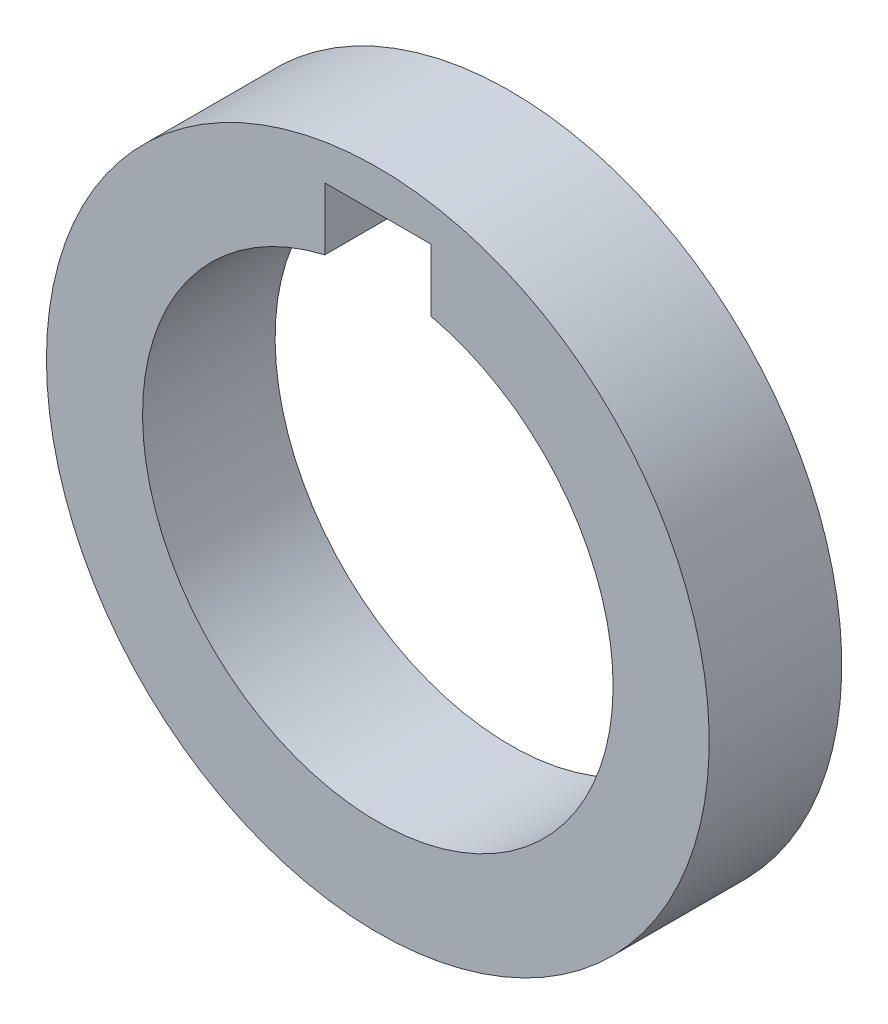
ISO-10303-21;
HEADER;
FILE_DESCRIPTION(('STEP AP214'),'2;1');
FILE_NAME('part.step','',(''),(''),'','','');
FILE_SCHEMA(('AUTOMOTIVE_DESIGN { 1 0 10303 214 1 1 1 1 }'));
ENDSEC;
DATA;
#1=APPLICATION_CONTEXT('core data for automotive mechanical design processes');
#2=APPLICATION_PROTOCOL_DEFINITION('international standard','automotive_design',2000,#1);
#3=PRODUCT_CONTEXT('',#1,'mechanical');
#4=PRODUCT('Part','Part','',(#3));
#5=PRODUCT_RELATED_PRODUCT_CATEGORY('part','',(#4));
#6=PRODUCT_DEFINITION_FORMATION('','',#4);
#7=PRODUCT_DEFINITION_CONTEXT('part definition',#1,'design');
#8=PRODUCT_DEFINITION('design','',#6,#7);
#9=PRODUCT_DEFINITION_SHAPE('','',#8);
#10=(LENGTH_UNIT() NAMED_UNIT(*) SI_UNIT(.MILLI.,.METRE.));
#11=(NAMED_UNIT(*) PLANE_ANGLE_UNIT() SI_UNIT($,.RADIAN.));
#12=(NAMED_UNIT(*) SI_UNIT($,.STERADIAN.) SOLID_ANGLE_UNIT());
#13=UNCERTAINTY_MEASURE_WITH_UNIT(LENGTH_MEASURE(1.E-05),#10,'distance_accuracy_value','');
#14=(GEOMETRIC_REPRESENTATION_CONTEXT(3) GLOBAL_UNCERTAINTY_ASSIGNED_CONTEXT((#13)) GLOBAL_UNIT_ASSIGNED_CONTEXT((#10,
#11,#12)) REPRESENTATION_CONTEXT('',''));
#15=CARTESIAN_POINT('',(0.,0.,0.));
#16=DIRECTION('',(0.,0.,1.));
#17=DIRECTION('',(1.,0.,0.));
#18=AXIS2_PLACEMENT_3D('',#15,#16,#17);
#19=CARTESIAN_POINT('',(0.,0.,10.));
#20=DIRECTION('',(0.,0.,0.999999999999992));
#21=DIRECTION('',(0.999999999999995,0.,0.));
#22=AXIS2_PLACEMENT_3D('',#19,#20,#21);
#23=PLANE('',#22);
#24=CARTESIAN_POINT('',(0.,0.,10.));
#25=DIRECTION('',(0.,0.,0.999999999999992));
#26=DIRECTION('',(0.999999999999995,0.,0.));
#27=AXIS2_PLACEMENT_3D('',#24,#25,#26);
#28=CIRCLE('',#27,25.);
#29=CARTESIAN_POINT('',(-24.9999999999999,0.,10.));
#30=VERTEX_POINT('',#29);
#31=EDGE_CURVE('E11',#30,#30,#28,.T.);
#32=ORIENTED_EDGE('',*,*,#31,.T.);
#33=EDGE_LOOP('',(#32));
#34=FACE_BOUND('',#33,.T.);
#35=CARTESIAN_POINT('',(0.,0.,10.));
#36=DIRECTION('',(0.,0.,0.999999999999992));
#37=DIRECTION('',(0.999999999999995,0.,0.));
#38=AXIS2_PLACEMENT_3D('',#35,#36,#37);
#39=CIRCLE('',#38,17.75);
#40=CARTESIAN_POINT('',(-3.99999999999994,17.2934236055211,10.));
#41=VERTEX_POINT('',#40);
#42=CARTESIAN_POINT('',(4.00000000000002,17.2934236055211,10.));
#43=VERTEX_POINT('',#42);
#44=EDGE_CURVE('E82',#41,#43,#39,.T.);
#45=ORIENTED_EDGE('',*,*,#44,.F.);
#46=DIRECTION('',(0.,-0.999999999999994,0.));
#47=VECTOR('',#46,1.);
#48=CARTESIAN_POINT('',(-3.99999999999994,21.9999999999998,10.));
#49=LINE('',#48,#47);
#50=CARTESIAN_POINT('',(-3.99999999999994,21.9999999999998,10.));
#51=VERTEX_POINT('',#50);
#52=EDGE_CURVE('E72',#51,#41,#49,.T.);
#53=ORIENTED_EDGE('',*,*,#52,.F.);
#54=DIRECTION('',(-0.999999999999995,0.,0.));
#55=VECTOR('',#54,1.);
#56=CARTESIAN_POINT('',(-3.99999999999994,21.9999999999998,10.));
#57=LINE('',#56,#55);
#58=CARTESIAN_POINT('',(4.00000000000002,21.9999999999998,10.));
#59=VERTEX_POINT('',#58);
#60=EDGE_CURVE('E86',#59,#51,#57,.T.);
#61=ORIENTED_EDGE('',*,*,#60,.F.);
#62=DIRECTION('',(0.,0.999999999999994,0.));
#63=VECTOR('',#62,1.);
#64=CARTESIAN_POINT('',(4.00000000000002,21.9999999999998,10.));
#65=LINE('',#64,#63);
#66=EDGE_CURVE('E84',#43,#59,#65,.T.);
#67=ORIENTED_EDGE('',*,*,#66,.F.);
#68=EDGE_LOOP('',(#45,#53,#61,#67));
#69=FACE_BOUND('',#68,.T.);
#70=ADVANCED_FACE('F16',(#34,#69),#23,.T.);
#71=CARTESIAN_POINT('',(0.,0.,0.));
#72=DIRECTION('',(0.,0.,0.999999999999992));
#73=DIRECTION('',(0.999999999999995,0.,0.));
#74=AXIS2_PLACEMENT_3D('',#71,#72,#73);
#75=PLANE('',#74);
#76=CARTESIAN_POINT('',(0.,0.,0.));
#77=DIRECTION('',(0.,0.,0.999999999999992));
#78=DIRECTION('',(0.999999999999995,0.,0.));
#79=AXIS2_PLACEMENT_3D('',#76,#77,#78);
#80=CIRCLE('',#79,25.);
#81=CARTESIAN_POINT('',(-24.9999999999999,0.,0.));
#82=VERTEX_POINT('',#81);
#83=EDGE_CURVE('E24',#82,#82,#80,.T.);
#84=ORIENTED_EDGE('',*,*,#83,.F.);
#85=EDGE_LOOP('',(#84));
#86=FACE_BOUND('',#85,.T.);
#87=DIRECTION('',(0.,-0.999999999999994,0.));
#88=VECTOR('',#87,1.);
#89=CARTESIAN_POINT('',(-3.99999999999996,21.9999999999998,0.));
#90=LINE('',#89,#88);
#91=CARTESIAN_POINT('',(-3.99999999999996,21.9999999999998,0.));
#92=VERTEX_POINT('',#91);
#93=CARTESIAN_POINT('',(-3.99999999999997,17.2934236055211,0.));
#94=VERTEX_POINT('',#93);
#95=EDGE_CURVE('E39',#92,#94,#90,.T.);
#96=ORIENTED_EDGE('',*,*,#95,.T.);
#97=CARTESIAN_POINT('',(0.,0.,0.));
#98=DIRECTION('',(0.,0.,0.999999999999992));
#99=DIRECTION('',(0.999999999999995,0.,0.));
#100=AXIS2_PLACEMENT_3D('',#97,#98,#99);
#101=CIRCLE('',#100,17.75);
#102=CARTESIAN_POINT('',(4.,17.2934236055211,0.));
#103=VERTEX_POINT('',#102);
#104=EDGE_CURVE('E59',#94,#103,#101,.T.);
#105=ORIENTED_EDGE('',*,*,#104,.T.);
#106=DIRECTION('',(0.,0.999999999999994,0.));
#107=VECTOR('',#106,1.);
#108=CARTESIAN_POINT('',(4.,21.9999999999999,0.));
#109=LINE('',#108,#107);
#110=CARTESIAN_POINT('',(4.,21.9999999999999,0.));
#111=VERTEX_POINT('',#110);
#112=EDGE_CURVE('E68',#103,#111,#109,.T.);
#113=ORIENTED_EDGE('',*,*,#112,.T.);
#114=DIRECTION('',(-0.999999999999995,0.,0.));
#115=VECTOR('',#114,1.);
#116=CARTESIAN_POINT('',(-3.99999999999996,21.9999999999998,0.));
#117=LINE('',#116,#115);
#118=EDGE_CURVE('E76',#111,#92,#117,.T.);
#119=ORIENTED_EDGE('',*,*,#118,.T.);
#120=EDGE_LOOP('',(#96,#105,#113,#119));
#121=FACE_BOUND('',#120,.T.);
#122=ADVANCED_FACE('F75',(#86,#121),#75,.F.);
#123=CARTESIAN_POINT('',(0.,0.,10.));
#124=DIRECTION('',(0.,0.,-0.999999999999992));
#125=DIRECTION('',(-0.999999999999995,0.,0.));
#126=AXIS2_PLACEMENT_3D('',#123,#124,#125);
#127=CYLINDRICAL_SURFACE('',#126,25.);
#128=CARTESIAN_POINT('',(-24.9999999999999,0.,10.));
#129=CARTESIAN_POINT('',(-24.9999999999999,0.,9.89583333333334));
#130=CARTESIAN_POINT('',(-24.9999999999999,0.,9.79166666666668));
#131=CARTESIAN_POINT('',(-24.9999999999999,0.,9.58333333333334));
#132=CARTESIAN_POINT('',(-24.9999999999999,0.,9.47916666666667));
#133=CARTESIAN_POINT('',(-24.9999999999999,0.,9.27083333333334));
#134=CARTESIAN_POINT('',(-24.9999999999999,0.,9.16666666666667));
#135=CARTESIAN_POINT('',(-24.9999999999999,0.,8.95833333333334));
#136=CARTESIAN_POINT('',(-24.9999999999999,0.,8.85416666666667));
#137=CARTESIAN_POINT('',(-24.9999999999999,0.,8.64583333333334));
#138=CARTESIAN_POINT('',(-24.9999999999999,0.,8.54166666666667));
#139=CARTESIAN_POINT('',(-24.9999999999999,0.,8.33333333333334));
#140=CARTESIAN_POINT('',(-24.9999999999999,0.,8.22916666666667));
#141=CARTESIAN_POINT('',(-24.9999999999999,0.,8.02083333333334));
#142=CARTESIAN_POINT('',(-24.9999999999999,0.,7.91666666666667));
#143=CARTESIAN_POINT('',(-24.9999999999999,0.,7.70833333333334));
#144=CARTESIAN_POINT('',(-24.9999999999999,0.,7.60416666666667));
#145=CARTESIAN_POINT('',(-24.9999999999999,0.,7.39583333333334));
#146=CARTESIAN_POINT('',(-24.9999999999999,0.,7.29166666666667));
#147=CARTESIAN_POINT('',(-24.9999999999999,0.,7.08333333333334));
#148=CARTESIAN_POINT('',(-24.9999999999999,0.,6.97916666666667));
#149=CARTESIAN_POINT('',(-24.9999999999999,0.,6.77083333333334));
#150=CARTESIAN_POINT('',(-24.9999999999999,0.,6.66666666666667));
#151=CARTESIAN_POINT('',(-24.9999999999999,0.,6.45833333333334));
#152=CARTESIAN_POINT('',(-24.9999999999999,0.,6.35416666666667));
#153=CARTESIAN_POINT('',(-24.9999999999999,0.,6.14583333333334));
#154=CARTESIAN_POINT('',(-24.9999999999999,0.,6.04166666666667));
#155=CARTESIAN_POINT('',(-24.9999999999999,0.,5.83333333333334));
#156=CARTESIAN_POINT('',(-24.9999999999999,0.,5.72916666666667));
#157=CARTESIAN_POINT('',(-24.9999999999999,0.,5.52083333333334));
#158=CARTESIAN_POINT('',(-24.9999999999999,0.,5.41666666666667));
#159=CARTESIAN_POINT('',(-24.9999999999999,0.,5.20833333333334));
#160=CARTESIAN_POINT('',(-24.9999999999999,0.,5.10416666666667));
#161=CARTESIAN_POINT('',(-24.9999999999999,0.,4.89583333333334));
#162=CARTESIAN_POINT('',(-24.9999999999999,0.,4.79166666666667));
#163=CARTESIAN_POINT('',(-24.9999999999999,0.,4.58333333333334));
#164=CARTESIAN_POINT('',(-24.9999999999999,0.,4.47916666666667));
#165=CARTESIAN_POINT('',(-24.9999999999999,0.,4.27083333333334));
#166=CARTESIAN_POINT('',(-24.9999999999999,0.,4.16666666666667));
#167=CARTESIAN_POINT('',(-24.9999999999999,0.,3.95833333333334));
#168=CARTESIAN_POINT('',(-24.9999999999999,0.,3.85416666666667));
#169=CARTESIAN_POINT('',(-24.9999999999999,0.,3.64583333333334));
#170=CARTESIAN_POINT('',(-24.9999999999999,0.,3.54166666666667));
#171=CARTESIAN_POINT('',(-24.9999999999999,0.,3.33333333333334));
#172=CARTESIAN_POINT('',(-24.9999999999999,0.,3.22916666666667));
#173=CARTESIAN_POINT('',(-24.9999999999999,0.,3.02083333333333));
#174=CARTESIAN_POINT('',(-24.9999999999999,0.,2.91666666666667));
#175=CARTESIAN_POINT('',(-24.9999999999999,0.,2.70833333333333));
#176=CARTESIAN_POINT('',(-24.9999999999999,0.,2.60416666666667));
#177=CARTESIAN_POINT('',(-24.9999999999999,0.,2.39583333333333));
#178=CARTESIAN_POINT('',(-24.9999999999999,0.,2.29166666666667));
#179=CARTESIAN_POINT('',(-24.9999999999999,0.,2.08333333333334));
#180=CARTESIAN_POINT('',(-24.9999999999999,0.,1.97916666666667));
#181=CARTESIAN_POINT('',(-24.9999999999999,0.,1.77083333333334));
#182=CARTESIAN_POINT('',(-24.9999999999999,0.,1.66666666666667));
#183=CARTESIAN_POINT('',(-24.9999999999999,0.,1.45833333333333));
#184=CARTESIAN_POINT('',(-24.9999999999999,0.,1.35416666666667));
#185=CARTESIAN_POINT('',(-24.9999999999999,0.,1.14583333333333));
#186=CARTESIAN_POINT('',(-24.9999999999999,0.,1.04166666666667));
#187=CARTESIAN_POINT('',(-24.9999999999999,0.,0.833333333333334));
#188=CARTESIAN_POINT('',(-24.9999999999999,0.,0.729166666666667));
#189=CARTESIAN_POINT('',(-24.9999999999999,0.,0.520833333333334));
#190=CARTESIAN_POINT('',(-24.9999999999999,0.,0.416666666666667));
#191=CARTESIAN_POINT('',(-24.9999999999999,0.,0.208333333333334));
#192=CARTESIAN_POINT('',(-24.9999999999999,0.,0.104166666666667));
#193=CARTESIAN_POINT('',(-24.9999999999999,0.,0.));
#194=B_SPLINE_CURVE_WITH_KNOTS('',3,(#128,#129,#130,#131,#132,#133,#134,#135,#136,#137,#138,
#139,#140,#141,#142,#143,#144,#145,#146,#147,#148,#149,#150,#151,#152,#153,#154,#155,#156,#157,
#158,#159,#160,#161,#162,#163,#164,#165,#166,#167,#168,#169,#170,#171,#172,#173,#174,#175,#176,
#177,#178,#179,#180,#181,#182,#183,#184,#185,#186,#187,#188,#189,#190,#191,#192,#193),
.UNSPECIFIED.,.F.,.F.,(4,2,2,2,2,2,2,2,2,2,2,2,2,2,2,2,2,2,2,2,2,2,2,2,2,2,2,2,2,2,2,2,4),(0.,
0.3125,0.625000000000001,0.937500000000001,1.25,1.5625,1.875,2.1875,2.5,2.8125,3.125,3.4375,
3.75,4.0625,4.375,4.68750000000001,5.00000000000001,5.31250000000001,5.62500000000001,
5.93750000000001,6.25000000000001,6.56250000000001,6.87500000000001,7.18750000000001,
7.50000000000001,7.81250000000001,8.12500000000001,8.43750000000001,8.75000000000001,
9.06250000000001,9.37500000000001,9.68750000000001,10.),.UNSPECIFIED.);
#195=EDGE_CURVE('BSEAM18',#30,#82,#194,.T.);
#196=ORIENTED_EDGE('',*,*,#31,.F.);
#197=ORIENTED_EDGE('',*,*,#83,.T.);
#198=ORIENTED_EDGE('',*,*,#195,.T.);
#199=ORIENTED_EDGE('',*,*,#195,.F.);
#200=EDGE_LOOP('',(#196,#198,#197,#199));
#201=FACE_BOUND('',#200,.T.);
#202=ADVANCED_FACE('F18',(#201),#127,.T.);
#203=CARTESIAN_POINT('',(-3.99999999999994,21.9999999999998,10.));
#204=DIRECTION('',(0.999999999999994,0.,0.));
#205=DIRECTION('',(0.,0.999999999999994,0.));
#206=AXIS2_PLACEMENT_3D('',#203,#204,#205);
#207=PLANE('',#206);
#208=ORIENTED_EDGE('',*,*,#95,.F.);
#209=DIRECTION('',(0.,0.,-0.999999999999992));
#210=VECTOR('',#209,1.);
#211=CARTESIAN_POINT('',(-3.99999999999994,21.9999999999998,10.));
#212=LINE('',#211,#210);
#213=EDGE_CURVE('E88',#51,#92,#212,.T.);
#214=ORIENTED_EDGE('',*,*,#213,.F.);
#215=ORIENTED_EDGE('',*,*,#52,.T.);
#216=DIRECTION('',(0.,0.,-0.999999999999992));
#217=VECTOR('',#216,1.);
#218=CARTESIAN_POINT('',(-3.99999999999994,17.2934236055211,10.));
#219=LINE('',#218,#217);
#220=EDGE_CURVE('E61',#41,#94,#219,.T.);
#221=ORIENTED_EDGE('',*,*,#220,.T.);
#222=EDGE_LOOP('',(#208,#214,#215,#221));
#223=FACE_BOUND('',#222,.T.);
#224=ADVANCED_FACE('F70',(#223),#207,.T.);
#225=CARTESIAN_POINT('',(0.,0.,10.));
#226=DIRECTION('',(0.,0.,-0.999999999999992));
#227=DIRECTION('',(-0.999999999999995,0.,0.));
#228=AXIS2_PLACEMENT_3D('',#225,#226,#227);
#229=CYLINDRICAL_SURFACE('',#228,17.75);
#230=ORIENTED_EDGE('',*,*,#104,.F.);
#231=ORIENTED_EDGE('',*,*,#220,.F.);
#232=ORIENTED_EDGE('',*,*,#44,.T.);
#233=DIRECTION('',(0.,0.,-0.999999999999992));
#234=VECTOR('',#233,1.);
#235=CARTESIAN_POINT('',(4.00000000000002,17.2934236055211,10.));
#236=LINE('',#235,#234);
#237=EDGE_CURVE('E64',#43,#103,#236,.T.);
#238=ORIENTED_EDGE('',*,*,#237,.T.);
#239=EDGE_LOOP('',(#230,#231,#232,#238));
#240=FACE_BOUND('',#239,.T.);
#241=ADVANCED_FACE('F60',(#240),#229,.F.);
#242=CARTESIAN_POINT('',(4.00000000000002,21.9999999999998,10.));
#243=DIRECTION('',(-0.999999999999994,0.,0.));
#244=DIRECTION('',(0.,-0.999999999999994,0.));
#245=AXIS2_PLACEMENT_3D('',#242,#243,#244);
#246=PLANE('',#245);
#247=ORIENTED_EDGE('',*,*,#112,.F.);
#248=ORIENTED_EDGE('',*,*,#237,.F.);
#249=ORIENTED_EDGE('',*,*,#66,.T.);
#250=DIRECTION('',(0.,0.,-0.999999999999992));
#251=VECTOR('',#250,1.);
#252=CARTESIAN_POINT('',(4.00000000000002,21.9999999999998,10.));
#253=LINE('',#252,#251);
#254=EDGE_CURVE('E31',#59,#111,#253,.T.);
#255=ORIENTED_EDGE('',*,*,#254,.T.);
#256=EDGE_LOOP('',(#247,#248,#249,#255));
#257=FACE_BOUND('',#256,.T.);
#258=ADVANCED_FACE('F109',(#257),#246,.T.);
#259=CARTESIAN_POINT('',(-3.99999999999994,21.9999999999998,10.));
#260=DIRECTION('',(0.,-0.999999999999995,0.));
#261=DIRECTION('',(0.,0.,-0.999999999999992));
#262=AXIS2_PLACEMENT_3D('',#259,#260,#261);
#263=PLANE('',#262);
#264=ORIENTED_EDGE('',*,*,#118,.F.);
#265=ORIENTED_EDGE('',*,*,#254,.F.);
#266=ORIENTED_EDGE('',*,*,#60,.T.);
#267=ORIENTED_EDGE('',*,*,#213,.T.);
#268=EDGE_LOOP('',(#264,#265,#266,#267));
#269=FACE_BOUND('',#268,.T.);
#270=ADVANCED_FACE('F112',(#269),#263,.T.);
#271=CLOSED_SHELL('',(#70,#122,#202,#224,#241,#258,#270));
#272=MANIFOLD_SOLID_BREP('B1',#271);
#273=ADVANCED_BREP_SHAPE_REPRESENTATION('',(#18,#272),#14);
#274=SHAPE_DEFINITION_REPRESENTATION(#9,#273);
ENDSEC;
END-ISO-10303-21;
